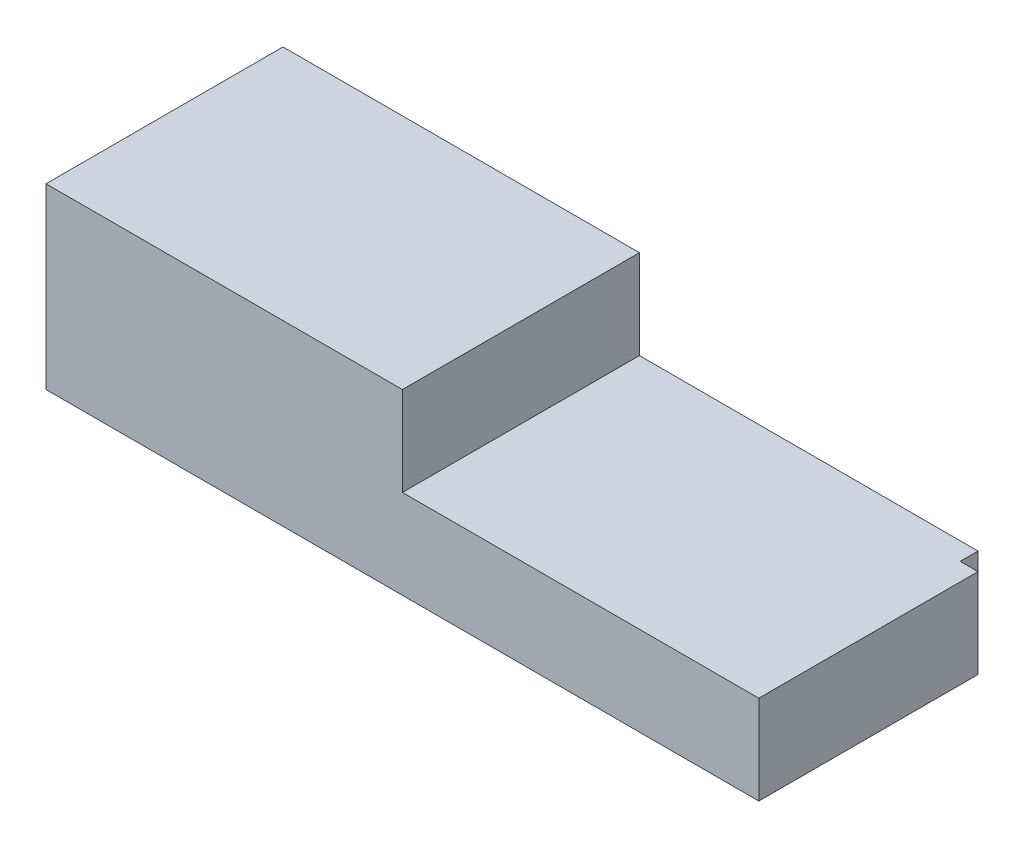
ISO-10303-21;
HEADER;
FILE_DESCRIPTION(('STEP AP214'),'2;1');
FILE_NAME('part.step','',(''),(''),'','','');
FILE_SCHEMA(('AUTOMOTIVE_DESIGN { 1 0 10303 214 1 1 1 1 }'));
ENDSEC;
DATA;
#1=APPLICATION_CONTEXT('core data for automotive mechanical design processes');
#2=APPLICATION_PROTOCOL_DEFINITION('international standard','automotive_design',2000,#1);
#3=PRODUCT_CONTEXT('',#1,'mechanical');
#4=PRODUCT('Part','Part','',(#3));
#5=PRODUCT_RELATED_PRODUCT_CATEGORY('part','',(#4));
#6=PRODUCT_DEFINITION_FORMATION('','',#4);
#7=PRODUCT_DEFINITION_CONTEXT('part definition',#1,'design');
#8=PRODUCT_DEFINITION('design','',#6,#7);
#9=PRODUCT_DEFINITION_SHAPE('','',#8);
#10=(LENGTH_UNIT() NAMED_UNIT(*) SI_UNIT(.MILLI.,.METRE.));
#11=(NAMED_UNIT(*) PLANE_ANGLE_UNIT() SI_UNIT($,.RADIAN.));
#12=(NAMED_UNIT(*) SI_UNIT($,.STERADIAN.) SOLID_ANGLE_UNIT());
#13=UNCERTAINTY_MEASURE_WITH_UNIT(LENGTH_MEASURE(1.E-05),#10,'distance_accuracy_value','');
#14=(GEOMETRIC_REPRESENTATION_CONTEXT(3) GLOBAL_UNCERTAINTY_ASSIGNED_CONTEXT((#13)) GLOBAL_UNIT_ASSIGNED_CONTEXT((#10,
#11,#12)) REPRESENTATION_CONTEXT('',''));
#15=CARTESIAN_POINT('',(0.,0.,0.));
#16=DIRECTION('',(0.,0.,1.));
#17=DIRECTION('',(1.,0.,0.));
#18=AXIS2_PLACEMENT_3D('',#15,#16,#17);
#19=CARTESIAN_POINT('',(0.,0.,13.3));
#20=DIRECTION('',(0.,1.,0.));
#21=DIRECTION('',(0.,0.,1.));
#22=AXIS2_PLACEMENT_3D('',#19,#20,#21);
#23=PLANE('',#22);
#24=DIRECTION('',(0.,0.,1.));
#25=VECTOR('',#24,1.);
#26=CARTESIAN_POINT('',(39.,0.,13.3));
#27=LINE('',#26,#25);
#28=CARTESIAN_POINT('',(39.,0.,0.));
#29=VERTEX_POINT('',#28);
#30=CARTESIAN_POINT('',(39.,0.,1.));
#31=VERTEX_POINT('',#30);
#32=EDGE_CURVE('E46',#29,#31,#27,.T.);
#33=ORIENTED_EDGE('',*,*,#32,.T.);
#34=DIRECTION('',(1.,0.,0.));
#35=VECTOR('',#34,1.);
#36=CARTESIAN_POINT('',(0.,0.,0.999999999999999));
#37=LINE('',#36,#35);
#38=CARTESIAN_POINT('',(40.,0.,1.));
#39=VERTEX_POINT('',#38);
#40=EDGE_CURVE('E126',#31,#39,#37,.T.);
#41=ORIENTED_EDGE('',*,*,#40,.T.);
#42=DIRECTION('',(0.,0.,-1.));
#43=VECTOR('',#42,1.);
#44=CARTESIAN_POINT('',(40.,0.,13.3));
#45=LINE('',#44,#43);
#46=CARTESIAN_POINT('',(40.,0.,13.3));
#47=VERTEX_POINT('',#46);
#48=EDGE_CURVE('E139',#47,#39,#45,.T.);
#49=ORIENTED_EDGE('',*,*,#48,.F.);
#50=DIRECTION('',(1.,0.,0.));
#51=VECTOR('',#50,1.);
#52=CARTESIAN_POINT('',(0.,0.,13.3));
#53=LINE('',#52,#51);
#54=CARTESIAN_POINT('',(0.,0.,13.3));
#55=VERTEX_POINT('',#54);
#56=EDGE_CURVE('E132',#55,#47,#53,.T.);
#57=ORIENTED_EDGE('',*,*,#56,.F.);
#58=DIRECTION('',(0.,0.,-1.));
#59=VECTOR('',#58,1.);
#60=CARTESIAN_POINT('',(0.,0.,13.3));
#61=LINE('',#60,#59);
#62=CARTESIAN_POINT('',(0.,0.,0.));
#63=VERTEX_POINT('',#62);
#64=EDGE_CURVE('E118',#55,#63,#61,.T.);
#65=ORIENTED_EDGE('',*,*,#64,.T.);
#66=DIRECTION('',(1.,0.,0.));
#67=VECTOR('',#66,1.);
#68=CARTESIAN_POINT('',(0.,0.,0.));
#69=LINE('',#68,#67);
#70=EDGE_CURVE('E122',#63,#29,#69,.T.);
#71=ORIENTED_EDGE('',*,*,#70,.T.);
#72=EDGE_LOOP('',(#33,#41,#49,#57,#65,#71));
#73=FACE_BOUND('',#72,.T.);
#74=ADVANCED_FACE('F32',(#73),#23,.F.);
#75=CARTESIAN_POINT('',(40.,0.,13.3));
#76=DIRECTION('',(-1.,0.,0.));
#77=DIRECTION('',(0.,0.,1.));
#78=AXIS2_PLACEMENT_3D('',#75,#76,#77);
#79=PLANE('',#78);
#80=ORIENTED_EDGE('',*,*,#48,.T.);
#81=DIRECTION('',(0.,-1.,0.));
#82=VECTOR('',#81,1.);
#83=CARTESIAN_POINT('',(40.,76.6538606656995,1.));
#84=LINE('',#83,#82);
#85=CARTESIAN_POINT('',(40.,5.,1.));
#86=VERTEX_POINT('',#85);
#87=EDGE_CURVE('E263',#86,#39,#84,.T.);
#88=ORIENTED_EDGE('',*,*,#87,.F.);
#89=DIRECTION('',(0.,0.,-1.));
#90=VECTOR('',#89,1.);
#91=CARTESIAN_POINT('',(40.,5.,13.3));
#92=LINE('',#91,#90);
#93=CARTESIAN_POINT('',(40.,5.,13.3));
#94=VERTEX_POINT('',#93);
#95=EDGE_CURVE('E136',#94,#86,#92,.T.);
#96=ORIENTED_EDGE('',*,*,#95,.F.);
#97=DIRECTION('',(0.,1.,0.));
#98=VECTOR('',#97,1.);
#99=CARTESIAN_POINT('',(40.,0.,13.3));
#100=LINE('',#99,#98);
#101=EDGE_CURVE('E85',#47,#94,#100,.T.);
#102=ORIENTED_EDGE('',*,*,#101,.F.);
#103=EDGE_LOOP('',(#80,#88,#96,#102));
#104=FACE_BOUND('',#103,.T.);
#105=ADVANCED_FACE('F165',(#104),#79,.F.);
#106=CARTESIAN_POINT('',(20.,5.,13.3));
#107=DIRECTION('',(0.,-1.,0.));
#108=DIRECTION('',(0.,0.,-1.));
#109=AXIS2_PLACEMENT_3D('',#106,#107,#108);
#110=PLANE('',#109);
#111=ORIENTED_EDGE('',*,*,#95,.T.);
#112=DIRECTION('',(-1.,0.,0.));
#113=VECTOR('',#112,1.);
#114=CARTESIAN_POINT('',(20.,5.,0.999999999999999));
#115=LINE('',#114,#113);
#116=CARTESIAN_POINT('',(39.,5.,1.));
#117=VERTEX_POINT('',#116);
#118=EDGE_CURVE('E11',#86,#117,#115,.T.);
#119=ORIENTED_EDGE('',*,*,#118,.T.);
#120=DIRECTION('',(0.,0.,-1.));
#121=VECTOR('',#120,1.);
#122=CARTESIAN_POINT('',(39.,5.,13.3));
#123=LINE('',#122,#121);
#124=CARTESIAN_POINT('',(39.,5.,0.));
#125=VERTEX_POINT('',#124);
#126=EDGE_CURVE('E269',#117,#125,#123,.T.);
#127=ORIENTED_EDGE('',*,*,#126,.T.);
#128=DIRECTION('',(-1.,0.,0.));
#129=VECTOR('',#128,1.);
#130=CARTESIAN_POINT('',(20.,5.,0.));
#131=LINE('',#130,#129);
#132=CARTESIAN_POINT('',(20.,5.,0.));
#133=VERTEX_POINT('',#132);
#134=EDGE_CURVE('E125',#125,#133,#131,.T.);
#135=ORIENTED_EDGE('',*,*,#134,.T.);
#136=DIRECTION('',(0.,0.,-1.));
#137=VECTOR('',#136,1.);
#138=CARTESIAN_POINT('',(20.,5.,13.3));
#139=LINE('',#138,#137);
#140=CARTESIAN_POINT('',(20.,5.,13.3));
#141=VERTEX_POINT('',#140);
#142=EDGE_CURVE('E113',#141,#133,#139,.T.);
#143=ORIENTED_EDGE('',*,*,#142,.F.);
#144=DIRECTION('',(-1.,0.,0.));
#145=VECTOR('',#144,1.);
#146=CARTESIAN_POINT('',(20.,5.,13.3));
#147=LINE('',#146,#145);
#148=EDGE_CURVE('E101',#94,#141,#147,.T.);
#149=ORIENTED_EDGE('',*,*,#148,.F.);
#150=EDGE_LOOP('',(#111,#119,#127,#135,#143,#149));
#151=FACE_BOUND('',#150,.T.);
#152=ADVANCED_FACE('F169',(#151),#110,.F.);
#153=CARTESIAN_POINT('',(20.,5.,13.3));
#154=DIRECTION('',(-1.,0.,0.));
#155=DIRECTION('',(0.,0.,1.));
#156=AXIS2_PLACEMENT_3D('',#153,#154,#155);
#157=PLANE('',#156);
#158=DIRECTION('',(0.,1.,0.));
#159=VECTOR('',#158,1.);
#160=CARTESIAN_POINT('',(20.,5.,0.));
#161=LINE('',#160,#159);
#162=CARTESIAN_POINT('',(20.,10.,0.));
#163=VERTEX_POINT('',#162);
#164=EDGE_CURVE('E110',#133,#163,#161,.T.);
#165=ORIENTED_EDGE('',*,*,#164,.T.);
#166=DIRECTION('',(0.,0.,-1.));
#167=VECTOR('',#166,1.);
#168=CARTESIAN_POINT('',(20.,10.,13.3));
#169=LINE('',#168,#167);
#170=CARTESIAN_POINT('',(20.,10.,13.3));
#171=VERTEX_POINT('',#170);
#172=EDGE_CURVE('E107',#171,#163,#169,.T.);
#173=ORIENTED_EDGE('',*,*,#172,.F.);
#174=DIRECTION('',(0.,1.,0.));
#175=VECTOR('',#174,1.);
#176=CARTESIAN_POINT('',(20.,5.,13.3));
#177=LINE('',#176,#175);
#178=EDGE_CURVE('E94',#141,#171,#177,.T.);
#179=ORIENTED_EDGE('',*,*,#178,.F.);
#180=ORIENTED_EDGE('',*,*,#142,.T.);
#181=EDGE_LOOP('',(#165,#173,#179,#180));
#182=FACE_BOUND('',#181,.T.);
#183=ADVANCED_FACE('F108',(#182),#157,.F.);
#184=CARTESIAN_POINT('',(0.,10.,13.3));
#185=DIRECTION('',(0.,-1.,0.));
#186=DIRECTION('',(0.,0.,-1.));
#187=AXIS2_PLACEMENT_3D('',#184,#185,#186);
#188=PLANE('',#187);
#189=DIRECTION('',(-1.,0.,0.));
#190=VECTOR('',#189,1.);
#191=CARTESIAN_POINT('',(0.,10.,0.));
#192=LINE('',#191,#190);
#193=CARTESIAN_POINT('',(0.,10.,0.));
#194=VERTEX_POINT('',#193);
#195=EDGE_CURVE('E129',#163,#194,#192,.T.);
#196=ORIENTED_EDGE('',*,*,#195,.T.);
#197=DIRECTION('',(0.,0.,-1.));
#198=VECTOR('',#197,1.);
#199=CARTESIAN_POINT('',(0.,10.,13.3));
#200=LINE('',#199,#198);
#201=CARTESIAN_POINT('',(0.,10.,13.3));
#202=VERTEX_POINT('',#201);
#203=EDGE_CURVE('E114',#202,#194,#200,.T.);
#204=ORIENTED_EDGE('',*,*,#203,.F.);
#205=DIRECTION('',(-1.,0.,0.));
#206=VECTOR('',#205,1.);
#207=CARTESIAN_POINT('',(0.,10.,13.3));
#208=LINE('',#207,#206);
#209=EDGE_CURVE('E98',#171,#202,#208,.T.);
#210=ORIENTED_EDGE('',*,*,#209,.F.);
#211=ORIENTED_EDGE('',*,*,#172,.T.);
#212=EDGE_LOOP('',(#196,#204,#210,#211));
#213=FACE_BOUND('',#212,.T.);
#214=ADVANCED_FACE('F116',(#213),#188,.F.);
#215=CARTESIAN_POINT('',(0.,0.,13.3));
#216=DIRECTION('',(1.,0.,0.));
#217=DIRECTION('',(0.,0.,-1.));
#218=AXIS2_PLACEMENT_3D('',#215,#216,#217);
#219=PLANE('',#218);
#220=CARTESIAN_POINT('',(0.,5.,6.10000000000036));
#221=DIRECTION('',(-1.,0.,0.));
#222=DIRECTION('',(0.,0.,1.));
#223=AXIS2_PLACEMENT_3D('',#220,#221,#222);
#224=CIRCLE('',#223,1.65000000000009);
#225=CARTESIAN_POINT('',(0.,5.,7.75000000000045));
#226=VERTEX_POINT('',#225);
#227=EDGE_CURVE('E261',#226,#226,#224,.T.);
#228=ORIENTED_EDGE('',*,*,#227,.F.);
#229=EDGE_LOOP('',(#228));
#230=FACE_BOUND('',#229,.T.);
#231=DIRECTION('',(0.,-1.,0.));
#232=VECTOR('',#231,1.);
#233=CARTESIAN_POINT('',(0.,0.,0.));
#234=LINE('',#233,#232);
#235=EDGE_CURVE('E76',#194,#63,#234,.T.);
#236=ORIENTED_EDGE('',*,*,#235,.T.);
#237=ORIENTED_EDGE('',*,*,#64,.F.);
#238=DIRECTION('',(0.,-1.,0.));
#239=VECTOR('',#238,1.);
#240=CARTESIAN_POINT('',(0.,0.,13.3));
#241=LINE('',#240,#239);
#242=EDGE_CURVE('E55',#202,#55,#241,.T.);
#243=ORIENTED_EDGE('',*,*,#242,.F.);
#244=ORIENTED_EDGE('',*,*,#203,.T.);
#245=EDGE_LOOP('',(#236,#237,#243,#244));
#246=FACE_BOUND('',#245,.T.);
#247=ADVANCED_FACE('F152',(#230,#246),#219,.F.);
#248=CARTESIAN_POINT('',(40.,0.,13.3));
#249=DIRECTION('',(0.,0.,1.));
#250=DIRECTION('',(1.,0.,0.));
#251=AXIS2_PLACEMENT_3D('',#248,#249,#250);
#252=PLANE('',#251);
#253=ORIENTED_EDGE('',*,*,#56,.T.);
#254=ORIENTED_EDGE('',*,*,#101,.T.);
#255=ORIENTED_EDGE('',*,*,#148,.T.);
#256=ORIENTED_EDGE('',*,*,#178,.T.);
#257=ORIENTED_EDGE('',*,*,#209,.T.);
#258=ORIENTED_EDGE('',*,*,#242,.T.);
#259=EDGE_LOOP('',(#253,#254,#255,#256,#257,#258));
#260=FACE_BOUND('',#259,.T.);
#261=ADVANCED_FACE('F96',(#260),#252,.T.);
#262=CARTESIAN_POINT('',(40.,0.,0.));
#263=DIRECTION('',(0.,0.,1.));
#264=DIRECTION('',(1.,0.,0.));
#265=AXIS2_PLACEMENT_3D('',#262,#263,#264);
#266=PLANE('',#265);
#267=ORIENTED_EDGE('',*,*,#134,.F.);
#268=DIRECTION('',(0.,-1.,0.));
#269=VECTOR('',#268,1.);
#270=CARTESIAN_POINT('',(39.,0.,0.));
#271=LINE('',#270,#269);
#272=EDGE_CURVE('E39',#125,#29,#271,.T.);
#273=ORIENTED_EDGE('',*,*,#272,.T.);
#274=ORIENTED_EDGE('',*,*,#70,.F.);
#275=ORIENTED_EDGE('',*,*,#235,.F.);
#276=ORIENTED_EDGE('',*,*,#195,.F.);
#277=ORIENTED_EDGE('',*,*,#164,.F.);
#278=EDGE_LOOP('',(#267,#273,#274,#275,#276,#277));
#279=FACE_BOUND('',#278,.T.);
#280=ADVANCED_FACE('F143',(#279),#266,.F.);
#281=CARTESIAN_POINT('',(39.,76.6538606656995,1.));
#282=DIRECTION('',(0.,0.,1.));
#283=DIRECTION('',(1.,0.,0.));
#284=AXIS2_PLACEMENT_3D('',#281,#282,#283);
#285=PLANE('',#284);
#286=ORIENTED_EDGE('',*,*,#40,.F.);
#287=DIRECTION('',(0.,-1.,0.));
#288=VECTOR('',#287,1.);
#289=CARTESIAN_POINT('',(39.,76.6538606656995,1.));
#290=LINE('',#289,#288);
#291=EDGE_CURVE('E260',#117,#31,#290,.T.);
#292=ORIENTED_EDGE('',*,*,#291,.F.);
#293=ORIENTED_EDGE('',*,*,#118,.F.);
#294=ORIENTED_EDGE('',*,*,#87,.T.);
#295=EDGE_LOOP('',(#286,#292,#293,#294));
#296=FACE_BOUND('',#295,.T.);
#297=ADVANCED_FACE('F213',(#296),#285,.F.);
#298=CARTESIAN_POINT('',(39.,76.6538606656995,1.));
#299=DIRECTION('',(-1.,0.,0.));
#300=DIRECTION('',(0.,0.,1.));
#301=AXIS2_PLACEMENT_3D('',#298,#299,#300);
#302=PLANE('',#301);
#303=ORIENTED_EDGE('',*,*,#32,.F.);
#304=ORIENTED_EDGE('',*,*,#272,.F.);
#305=ORIENTED_EDGE('',*,*,#126,.F.);
#306=ORIENTED_EDGE('',*,*,#291,.T.);
#307=EDGE_LOOP('',(#303,#304,#305,#306));
#308=FACE_BOUND('',#307,.T.);
#309=ADVANCED_FACE('F221',(#308),#302,.F.);
#310=CARTESIAN_POINT('',(5.,5.,6.10000000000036));
#311=DIRECTION('',(-1.,0.,0.));
#312=DIRECTION('',(0.,0.,1.));
#313=AXIS2_PLACEMENT_3D('',#310,#311,#312);
#314=CYLINDRICAL_SURFACE('',#313,1.65000000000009);
#315=CARTESIAN_POINT('',(5.,5.,6.10000000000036));
#316=DIRECTION('',(-1.,0.,0.));
#317=DIRECTION('',(0.,0.,1.));
#318=AXIS2_PLACEMENT_3D('',#315,#316,#317);
#319=CIRCLE('',#318,1.65000000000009);
#320=CARTESIAN_POINT('',(5.,5.,7.75000000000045));
#321=VERTEX_POINT('',#320);
#322=EDGE_CURVE('E259',#321,#321,#319,.T.);
#323=ORIENTED_EDGE('',*,*,#322,.F.);
#324=EDGE_LOOP('',(#323));
#325=FACE_BOUND('',#324,.T.);
#326=ORIENTED_EDGE('',*,*,#227,.T.);
#327=EDGE_LOOP('',(#326));
#328=FACE_BOUND('',#327,.T.);
#329=ADVANCED_FACE('F230',(#325,#328),#314,.F.);
#330=CARTESIAN_POINT('',(5.,5.,6.10000000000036));
#331=DIRECTION('',(-1.,0.,0.));
#332=DIRECTION('',(0.,0.,1.));
#333=AXIS2_PLACEMENT_3D('',#330,#331,#332);
#334=PLANE('',#333);
#335=ORIENTED_EDGE('',*,*,#322,.T.);
#336=EDGE_LOOP('',(#335));
#337=FACE_BOUND('',#336,.T.);
#338=ADVANCED_FACE('F243',(#337),#334,.T.);
#339=CLOSED_SHELL('',(#74,#105,#152,#183,#214,#247,#261,#280,#297,#309,#329,#338));
#340=MANIFOLD_SOLID_BREP('B2',#339);
#341=ADVANCED_BREP_SHAPE_REPRESENTATION('',(#18,#340),#14);
#342=SHAPE_DEFINITION_REPRESENTATION(#9,#341);
ENDSEC;
END-ISO-10303-21;
